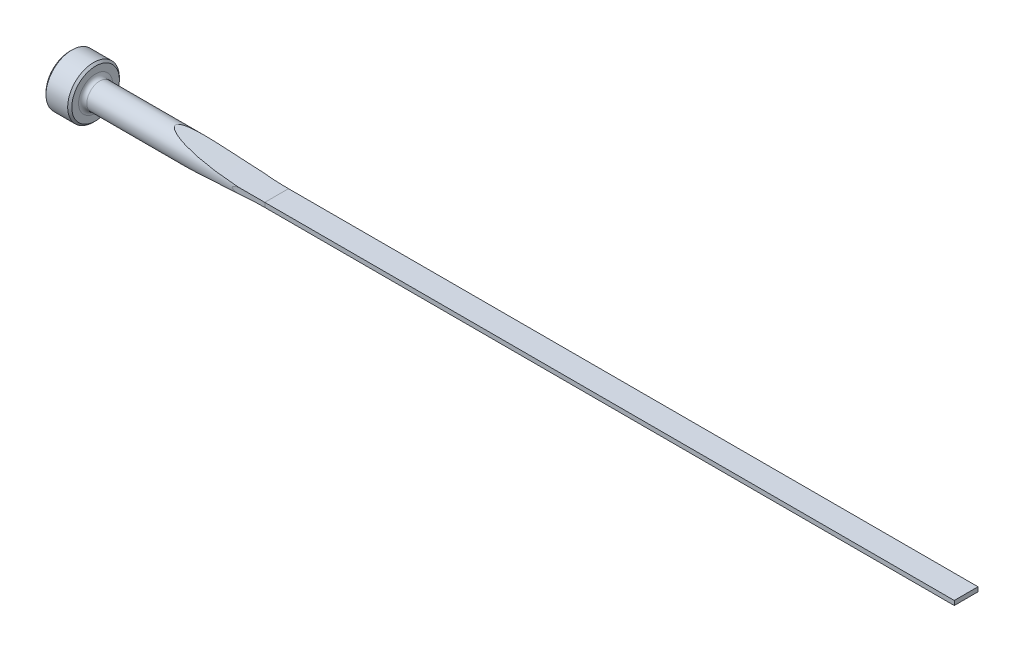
ISO-10303-21;
HEADER;
FILE_DESCRIPTION(('STEP AP214'),'2;1');
FILE_NAME('part.step','',(''),(''),'','','');
FILE_SCHEMA(('AUTOMOTIVE_DESIGN { 1 0 10303 214 1 1 1 1 }'));
ENDSEC;
DATA;
#1=APPLICATION_CONTEXT('core data for automotive mechanical design processes');
#2=APPLICATION_PROTOCOL_DEFINITION('international standard','automotive_design',2000,#1);
#3=PRODUCT_CONTEXT('',#1,'mechanical');
#4=PRODUCT('Part','Part','',(#3));
#5=PRODUCT_RELATED_PRODUCT_CATEGORY('part','',(#4));
#6=PRODUCT_DEFINITION_FORMATION('','',#4);
#7=PRODUCT_DEFINITION_CONTEXT('part definition',#1,'design');
#8=PRODUCT_DEFINITION('design','',#6,#7);
#9=PRODUCT_DEFINITION_SHAPE('','',#8);
#10=(LENGTH_UNIT() NAMED_UNIT(*) SI_UNIT(.MILLI.,.METRE.));
#11=(NAMED_UNIT(*) PLANE_ANGLE_UNIT() SI_UNIT($,.RADIAN.));
#12=(NAMED_UNIT(*) SI_UNIT($,.STERADIAN.) SOLID_ANGLE_UNIT());
#13=UNCERTAINTY_MEASURE_WITH_UNIT(LENGTH_MEASURE(1.E-05),#10,'distance_accuracy_value','');
#14=(GEOMETRIC_REPRESENTATION_CONTEXT(3) GLOBAL_UNCERTAINTY_ASSIGNED_CONTEXT((#13)) GLOBAL_UNIT_ASSIGNED_CONTEXT((#10,
#11,#12)) REPRESENTATION_CONTEXT('',''));
#15=CARTESIAN_POINT('',(0.,0.,0.));
#16=DIRECTION('',(0.,0.,1.));
#17=DIRECTION('',(1.,0.,0.));
#18=AXIS2_PLACEMENT_3D('',#15,#16,#17);
#19=CARTESIAN_POINT('',(0.,0.,0.));
#20=DIRECTION('',(-1.,0.,0.));
#21=DIRECTION('',(0.,0.,1.));
#22=AXIS2_PLACEMENT_3D('',#19,#20,#21);
#23=CYLINDRICAL_SURFACE('',#22,2.3749);
#24=CARTESIAN_POINT('',(5.5118,0.,0.));
#25=DIRECTION('',(-1.,0.,0.));
#26=DIRECTION('',(0.,0.,1.));
#27=AXIS2_PLACEMENT_3D('',#24,#25,#26);
#28=CIRCLE('',#27,2.3749);
#29=CARTESIAN_POINT('',(5.5118,0.,2.3749));
#30=VERTEX_POINT('',#29);
#31=EDGE_CURVE('E153',#30,#30,#28,.F.);
#32=ORIENTED_EDGE('',*,*,#31,.T.);
#33=EDGE_LOOP('',(#32));
#34=FACE_BOUND('',#33,.T.);
#35=CARTESIAN_POINT('',(38.1,0.931958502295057,2.18439999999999));
#36=CARTESIAN_POINT('',(37.9075515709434,0.931940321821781,2.18439976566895));
#37=CARTESIAN_POINT('',(37.7151013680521,0.930492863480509,2.18502490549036));
#38=CARTESIAN_POINT('',(37.3302234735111,0.924611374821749,2.18752450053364));
#39=CARTESIAN_POINT('',(37.1377957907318,0.920176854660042,2.18939916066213));
#40=CARTESIAN_POINT('',(36.7518341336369,0.908155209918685,2.19441218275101));
#41=CARTESIAN_POINT('',(36.5583008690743,0.900548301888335,2.19755847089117));
#42=CARTESIAN_POINT('',(36.1714442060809,0.881895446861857,2.20511052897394));
#43=CARTESIAN_POINT('',(35.9781207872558,0.870849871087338,2.20951616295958));
#44=CARTESIAN_POINT('',(35.5803005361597,0.844100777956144,2.21987943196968));
#45=CARTESIAN_POINT('',(35.3758212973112,0.828159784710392,2.2259136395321));
#46=CARTESIAN_POINT('',(34.9673129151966,0.791030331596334,2.23937732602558));
#47=CARTESIAN_POINT('',(34.7632839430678,0.769840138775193,2.24680726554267));
#48=CARTESIAN_POINT('',(34.35661740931,0.720830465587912,2.26301546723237));
#49=CARTESIAN_POINT('',(34.1539775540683,0.693029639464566,2.27178991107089));
#50=CARTESIAN_POINT('',(33.8512709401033,0.644172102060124,2.28592867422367));
#51=CARTESIAN_POINT('',(33.750603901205,0.626699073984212,2.29080303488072));
#52=CARTESIAN_POINT('',(33.5498678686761,0.588702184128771,2.30086330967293));
#53=CARTESIAN_POINT('',(33.4497987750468,0.568178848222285,2.30604917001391));
#54=CARTESIAN_POINT('',(33.3018199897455,0.534634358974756,2.31396676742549));
#55=CARTESIAN_POINT('',(33.2535509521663,0.523182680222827,2.3165891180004));
#56=CARTESIAN_POINT('',(33.1573085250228,0.499097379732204,2.32189592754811));
#57=CARTESIAN_POINT('',(33.1093351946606,0.486463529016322,2.32458039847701));
#58=CARTESIAN_POINT('',(32.9663526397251,0.446582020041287,2.33269738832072));
#59=CARTESIAN_POINT('',(32.8718724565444,0.417265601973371,2.33821536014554));
#60=CARTESIAN_POINT('',(32.7453639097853,0.370835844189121,2.34580058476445));
#61=CARTESIAN_POINT('',(32.7118331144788,0.357819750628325,2.34783049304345));
#62=CARTESIAN_POINT('',(32.6453758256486,0.330089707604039,2.35189084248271));
#63=CARTESIAN_POINT('',(32.61245087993,0.315371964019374,2.35392127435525));
#64=CARTESIAN_POINT('',(32.5466649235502,0.28318239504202,2.35801388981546));
#65=CARTESIAN_POINT('',(32.5138393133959,0.265637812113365,2.36007502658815));
#66=CARTESIAN_POINT('',(32.4503018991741,0.227094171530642,2.36409846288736));
#67=CARTESIAN_POINT('',(32.4195817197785,0.206110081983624,2.36606114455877));
#68=CARTESIAN_POINT('',(32.3807522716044,0.17363214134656,2.36855971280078));
#69=CARTESIAN_POINT('',(32.3706531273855,0.164553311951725,2.36921145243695));
#70=CARTESIAN_POINT('',(32.3513357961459,0.145453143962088,2.3704611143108));
#71=CARTESIAN_POINT('',(32.3421190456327,0.135430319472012,2.3710589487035));
#72=CARTESIAN_POINT('',(32.3248924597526,0.114162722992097,2.372178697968));
#73=CARTESIAN_POINT('',(32.3168989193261,0.10290439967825,2.3726995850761));
#74=CARTESIAN_POINT('',(32.3029630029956,0.0791761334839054,2.37360916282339));
#75=CARTESIAN_POINT('',(32.2970130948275,0.0667108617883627,2.37399833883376));
#76=CARTESIAN_POINT('',(32.2895493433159,0.0451214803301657,2.37448695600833));
#77=CARTESIAN_POINT('',(32.287216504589,0.0362843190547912,2.37463982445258));
#78=CARTESIAN_POINT('',(32.284070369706,0.018342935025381,2.3748460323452));
#79=CARTESIAN_POINT('',(32.28325542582,0.00923901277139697,2.37489947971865));
#80=CARTESIAN_POINT('',(32.2832396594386,-0.00898512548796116,2.37490051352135));
#81=CARTESIAN_POINT('',(32.2840414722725,-0.0181053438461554,2.37484792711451));
#82=CARTESIAN_POINT('',(32.2871682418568,-0.0360804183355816,2.37464298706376));
#83=CARTESIAN_POINT('',(32.2894948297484,-0.0449349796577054,2.37449052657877));
#84=CARTESIAN_POINT('',(32.296426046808,-0.0650505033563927,2.37403676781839));
#85=CARTESIAN_POINT('',(32.3015301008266,-0.0761364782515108,2.37370288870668));
#86=CARTESIAN_POINT('',(32.3134090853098,-0.0973644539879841,2.37292722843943));
#87=CARTESIAN_POINT('',(32.320188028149,-0.10750410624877,2.37248518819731));
#88=CARTESIAN_POINT('',(32.3406526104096,-0.134467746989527,2.37115359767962));
#89=CARTESIAN_POINT('',(32.3555945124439,-0.150320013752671,2.37018436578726));
#90=CARTESIAN_POINT('',(32.3874630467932,-0.179846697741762,2.36812651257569));
#91=CARTESIAN_POINT('',(32.4043958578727,-0.193514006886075,2.36703752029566));
#92=CARTESIAN_POINT('',(32.4500057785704,-0.226993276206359,2.36411848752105));
#93=CARTESIAN_POINT('',(32.4796018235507,-0.245533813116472,2.36223795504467));
#94=CARTESIAN_POINT('',(32.5403493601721,-0.279898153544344,2.3584104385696));
#95=CARTESIAN_POINT('',(32.5715045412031,-0.295715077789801,2.35646330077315));
#96=CARTESIAN_POINT('',(32.6666093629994,-0.340418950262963,2.35057165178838));
#97=CARTESIAN_POINT('',(32.7319170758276,-0.366382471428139,2.34659497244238));
#98=CARTESIAN_POINT('',(32.8741782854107,-0.417382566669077,2.3380950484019));
#99=CARTESIAN_POINT('',(32.9513848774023,-0.441669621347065,2.33358126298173));
#100=CARTESIAN_POINT('',(33.106961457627,-0.486276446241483,2.32469268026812));
#101=CARTESIAN_POINT('',(33.1853319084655,-0.506594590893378,2.32031794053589));
#102=CARTESIAN_POINT('',(33.4218439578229,-0.563416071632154,2.30743335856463));
#103=CARTESIAN_POINT('',(33.5810064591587,-0.595665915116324,2.29918591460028));
#104=CARTESIAN_POINT('',(33.9005735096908,-0.653182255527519,2.28349651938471));
#105=CARTESIAN_POINT('',(34.06097818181,-0.678448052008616,2.27605464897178));
#106=CARTESIAN_POINT('',(34.3823165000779,-0.723854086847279,2.26202300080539));
#107=CARTESIAN_POINT('',(34.5432491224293,-0.744001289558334,2.25543207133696));
#108=CARTESIAN_POINT('',(34.9686966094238,-0.792003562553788,2.23917011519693));
#109=CARTESIAN_POINT('',(35.2336093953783,-0.816543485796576,2.23022625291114));
#110=CARTESIAN_POINT('',(35.7642384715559,-0.85775890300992,2.21469349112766));
#111=CARTESIAN_POINT('',(36.0299551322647,-0.874429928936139,2.20810593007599));
#112=CARTESIAN_POINT('',(36.5612705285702,-0.901186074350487,2.19732116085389));
#113=CARTESIAN_POINT('',(36.8268685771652,-0.91128328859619,2.19311956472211));
#114=CARTESIAN_POINT('',(37.3582486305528,-0.92564325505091,2.18709742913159));
#115=CARTESIAN_POINT('',(37.6240306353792,-0.929906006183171,2.18527689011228));
#116=CARTESIAN_POINT('',(37.9598826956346,-0.931763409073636,2.18448280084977));
#117=CARTESIAN_POINT('',(38.0299416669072,-0.931956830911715,2.18439997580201));
#118=CARTESIAN_POINT('',(38.1,-0.931958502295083,2.18439999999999));
#119=B_SPLINE_CURVE_WITH_KNOTS('',3,(#35,#36,#37,#38,#39,#40,#41,#42,#43,#44,#45,#46,#47,#48,
#49,#50,#51,#52,#53,#54,#55,#56,#57,#58,#59,#60,#61,#62,#63,#64,#65,#66,#67,#68,#69,#70,#71,#72,
#73,#74,#75,#76,#77,#78,#79,#80,#81,#82,#83,#84,#85,#86,#87,#88,#89,#90,#91,#92,#93,#94,#95,#96,
#97,#98,#99,#100,#101,#102,#103,#104,#105,#106,#107,#108,#109,#110,#111,#112,#113,#114,#115,
#116,#117,#118),.UNSPECIFIED.,.F.,.F.,(4,2,2,2,2,2,2,2,2,2,2,2,2,2,2,2,2,2,2,2,2,2,2,2,2,2,2,2,
2,2,2,2,2,2,2,2,2,2,2,2,2,4),(0.,0.577341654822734,1.15477801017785,1.73587049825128,
2.31690027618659,2.93240275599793,3.54810870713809,4.16209742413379,4.46893047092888,
4.77571068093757,4.9247288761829,5.07377599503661,5.37061535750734,5.47866452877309,
5.58695943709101,5.69870175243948,5.80997010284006,5.85071283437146,5.89152080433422,
5.93283229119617,5.97398983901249,6.00129967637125,6.02857985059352,6.05590452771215,
6.08325848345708,6.11967760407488,6.1561848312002,6.22123367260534,6.28649000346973,
6.39114062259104,6.49605180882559,6.70686384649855,6.94992813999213,7.19309177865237,
7.68061293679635,8.16818297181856,8.65508602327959,9.45349626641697,10.2523593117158,
11.0497483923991,11.8471376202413,12.0573140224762),.UNSPECIFIED.);
#120=CARTESIAN_POINT('',(33.3071074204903,0.535694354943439,2.31369435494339));
#121=VERTEX_POINT('',#120);
#122=CARTESIAN_POINT('',(33.3071074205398,-0.535694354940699,2.31369435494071));
#123=VERTEX_POINT('',#122);
#124=EDGE_CURVE('E156',#121,#123,#119,.T.);
#125=ORIENTED_EDGE('',*,*,#124,.F.);
#126=CARTESIAN_POINT('',(38.1,0.406400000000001,2.33986945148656));
#127=CARTESIAN_POINT('',(37.7044168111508,0.406399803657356,2.33984948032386));
#128=CARTESIAN_POINT('',(37.3088333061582,0.409040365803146,2.33941010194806));
#129=CARTESIAN_POINT('',(36.5177233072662,0.419601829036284,2.33754961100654));
#130=CARTESIAN_POINT('',(36.1221968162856,0.4275229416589,2.33612845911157));
#131=CARTESIAN_POINT('',(35.3304473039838,0.448666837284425,2.33215725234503));
#132=CARTESIAN_POINT('',(34.9342245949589,0.461900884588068,2.32960479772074));
#133=CARTESIAN_POINT('',(34.1420171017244,0.493667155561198,2.32308149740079));
#134=CARTESIAN_POINT('',(33.7460323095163,0.51219918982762,2.31911070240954));
#135=CARTESIAN_POINT('',(32.9535202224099,0.554602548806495,2.30933764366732));
#136=CARTESIAN_POINT('',(32.5569935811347,0.578485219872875,2.30353147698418));
#137=CARTESIAN_POINT('',(31.7643370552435,0.631560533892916,2.28954911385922));
#138=CARTESIAN_POINT('',(31.3682071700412,0.660753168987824,2.28137292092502));
#139=CARTESIAN_POINT('',(30.5763063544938,0.724449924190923,2.26195322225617));
#140=CARTESIAN_POINT('',(30.1805356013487,0.758955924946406,2.25070862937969));
#141=CARTESIAN_POINT('',(29.3896269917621,0.833256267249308,2.22427297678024));
#142=CARTESIAN_POINT('',(28.9944891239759,0.873050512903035,2.20908198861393));
#143=CARTESIAN_POINT('',(28.2053195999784,0.957870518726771,2.17364869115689));
#144=CARTESIAN_POINT('',(27.8112873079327,1.00289202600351,2.15341047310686));
#145=CARTESIAN_POINT('',(27.0242497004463,1.0981527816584,2.10642646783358));
#146=CARTESIAN_POINT('',(26.6312443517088,1.14839185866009,2.07968089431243));
#147=CARTESIAN_POINT('',(25.8467997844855,1.25399752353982,2.01777261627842));
#148=CARTESIAN_POINT('',(25.4553597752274,1.30936105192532,1.98261491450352));
#149=CARTESIAN_POINT('',(24.8696668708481,1.39617734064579,1.92147807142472));
#150=CARTESIAN_POINT('',(24.6746928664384,1.42574258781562,1.8997007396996));
#151=CARTESIAN_POINT('',(24.2853329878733,1.48610747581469,1.85286228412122));
#152=CARTESIAN_POINT('',(24.090947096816,1.51690708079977,1.82780125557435));
#153=CARTESIAN_POINT('',(23.7027972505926,1.57972659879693,1.77379004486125));
#154=CARTESIAN_POINT('',(23.5090337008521,1.61174718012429,1.74483771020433));
#155=CARTESIAN_POINT('',(23.1224234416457,1.67694930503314,1.68227119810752));
#156=CARTESIAN_POINT('',(22.9295768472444,1.71013099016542,1.64865645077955));
#157=CARTESIAN_POINT('',(22.5454982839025,1.77751664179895,1.57576815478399));
#158=CARTESIAN_POINT('',(22.3542640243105,1.81171864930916,1.53650495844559));
#159=CARTESIAN_POINT('',(21.9736080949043,1.88107830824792,1.45077652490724));
#160=CARTESIAN_POINT('',(21.7841859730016,1.91623571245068,1.40431313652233));
#161=CARTESIAN_POINT('',(21.4545415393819,1.9785150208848,1.3144663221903));
#162=CARTESIAN_POINT('',(21.3137260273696,2.00547620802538,1.27315803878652));
#163=CARTESIAN_POINT('',(21.0340568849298,2.05971596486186,1.18342755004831));
#164=CARTESIAN_POINT('',(20.8952077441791,2.0869950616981,1.13499127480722));
#165=CARTESIAN_POINT('',(20.6903441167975,2.12774040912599,1.05533759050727));
#166=CARTESIAN_POINT('',(20.6229205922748,2.14123294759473,1.027759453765));
#167=CARTESIAN_POINT('',(20.4893070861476,2.16812981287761,0.969737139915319));
#168=CARTESIAN_POINT('',(20.4231168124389,2.18153416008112,0.939293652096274));
#169=CARTESIAN_POINT('',(20.2926184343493,2.20811308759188,0.874982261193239));
#170=CARTESIAN_POINT('',(20.2283052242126,2.22128824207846,0.841125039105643));
#171=CARTESIAN_POINT('',(20.1021420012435,2.24727503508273,0.769012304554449));
#172=CARTESIAN_POINT('',(20.0402897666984,2.26008699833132,0.730760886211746));
#173=CARTESIAN_POINT('',(19.9403180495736,2.28090012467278,0.662165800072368));
#174=CARTESIAN_POINT('',(19.9011456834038,2.28908441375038,0.63342184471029));
#175=CARTESIAN_POINT('',(19.8251269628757,2.30501770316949,0.572739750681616));
#176=CARTESIAN_POINT('',(19.7882839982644,2.31276606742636,0.540797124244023));
#177=CARTESIAN_POINT('',(19.7177924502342,2.32763389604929,0.472755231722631));
#178=CARTESIAN_POINT('',(19.6841755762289,2.33474707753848,0.43662116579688));
#179=CARTESIAN_POINT('',(19.622498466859,2.34782984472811,0.359666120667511));
#180=CARTESIAN_POINT('',(19.5944234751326,2.3538024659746,0.318858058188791));
#181=CARTESIAN_POINT('',(19.5557647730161,2.3620409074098,0.248316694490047));
#182=CARTESIAN_POINT('',(19.542557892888,2.3648594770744,0.220101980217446));
#183=CARTESIAN_POINT('',(19.5205811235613,2.36955326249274,0.161913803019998));
#184=CARTESIAN_POINT('',(19.5118054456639,2.37142970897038,0.131942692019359));
#185=CARTESIAN_POINT('',(19.4995504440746,2.37405090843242,0.0705758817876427));
#186=CARTESIAN_POINT('',(19.496118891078,2.3747854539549,0.0391698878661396));
#187=CARTESIAN_POINT('',(19.4951655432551,2.37498947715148,-0.0237379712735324));
#188=CARTESIAN_POINT('',(19.4976430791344,2.37445909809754,-0.0552398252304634));
#189=CARTESIAN_POINT('',(19.5076355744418,2.37232149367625,-0.114120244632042));
#190=CARTESIAN_POINT('',(19.5146229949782,2.37082704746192,-0.141596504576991));
#191=CARTESIAN_POINT('',(19.5324513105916,2.36701756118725,-0.195194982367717));
#192=CARTESIAN_POINT('',(19.5432944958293,2.36470203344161,-0.221316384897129));
#193=CARTESIAN_POINT('',(19.575995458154,2.35772732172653,-0.28812157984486));
#194=CARTESIAN_POINT('',(19.6004661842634,2.35251555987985,-0.327458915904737));
#195=CARTESIAN_POINT('',(19.6549219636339,2.34094780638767,-0.401925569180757));
#196=CARTESIAN_POINT('',(19.6849249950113,2.3345880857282,-0.437040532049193));
#197=CARTESIAN_POINT('',(19.7478725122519,2.32128385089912,-0.502883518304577));
#198=CARTESIAN_POINT('',(19.7807403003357,2.31435476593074,-0.533689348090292));
#199=CARTESIAN_POINT('',(19.8489037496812,2.30002838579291,-0.59239598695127));
#200=CARTESIAN_POINT('',(19.8842018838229,2.292630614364,-0.620293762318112));
#201=CARTESIAN_POINT('',(19.9565971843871,2.27750649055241,-0.673710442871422));
#202=CARTESIAN_POINT('',(19.9936982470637,2.26977943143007,-0.699223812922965));
#203=CARTESIAN_POINT('',(20.0691612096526,2.25411491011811,-0.748180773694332));
#204=CARTESIAN_POINT('',(20.1075225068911,2.24617754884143,-0.771625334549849));
#205=CARTESIAN_POINT('',(20.2136713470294,2.22428956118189,-0.833316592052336));
#206=CARTESIAN_POINT('',(20.2824349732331,2.2101921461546,-0.869829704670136));
#207=CARTESIAN_POINT('',(20.4219229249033,2.18177272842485,-0.938828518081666));
#208=CARTESIAN_POINT('',(20.4926484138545,2.16745059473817,-0.971311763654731));
#209=CARTESIAN_POINT('',(20.7071388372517,2.12429388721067,-1.06406057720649));
#210=CARTESIAN_POINT('',(20.8529626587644,2.0953216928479,-1.11948666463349));
#211=CARTESIAN_POINT('',(21.1483943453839,2.03741406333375,-1.2216871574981));
#212=CARTESIAN_POINT('',(21.2980180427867,2.00847961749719,-1.26841467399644));
#213=CARTESIAN_POINT('',(21.5238574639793,1.965416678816,-1.33339980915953));
#214=CARTESIAN_POINT('',(21.5993227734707,1.95112780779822,-1.3541988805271));
#215=CARTESIAN_POINT('',(21.7506704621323,1.92267524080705,-1.39430070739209));
#216=CARTESIAN_POINT('',(21.8265528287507,1.90851154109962,-1.41360350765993));
#217=CARTESIAN_POINT('',(22.0813454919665,1.86129873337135,-1.47605728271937));
#218=CARTESIAN_POINT('',(22.261048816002,1.82856748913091,-1.51622419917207));
#219=CARTESIAN_POINT('',(22.6218079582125,1.76401499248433,-1.59085660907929));
#220=CARTESIAN_POINT('',(22.8028640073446,1.73219390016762,-1.62532110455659));
#221=CARTESIAN_POINT('',(23.1660633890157,1.66952697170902,-1.68962914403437));
#222=CARTESIAN_POINT('',(23.3482072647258,1.63868168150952,-1.71947013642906));
#223=CARTESIAN_POINT('',(23.7132627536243,1.57803492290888,-1.77528798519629));
#224=CARTESIAN_POINT('',(23.8961744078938,1.54823351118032,-1.80126463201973));
#225=CARTESIAN_POINT('',(24.4467186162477,1.46030598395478,-1.87443797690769));
#226=CARTESIAN_POINT('',(24.8152663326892,1.40381094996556,-1.91672647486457));
#227=CARTESIAN_POINT('',(25.553854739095,1.29535770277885,-1.99160931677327));
#228=CARTESIAN_POINT('',(25.9238949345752,1.24339809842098,-2.02420664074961));
#229=CARTESIAN_POINT('',(26.6651082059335,1.1440892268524,-2.08194780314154));
#230=CARTESIAN_POINT('',(27.03628110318,1.0967392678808,-2.10709276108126));
#231=CARTESIAN_POINT('',(27.7795583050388,1.00669079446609,-2.15156688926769));
#232=CARTESIAN_POINT('',(28.1516626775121,0.96399262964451,-2.17089562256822));
#233=CARTESIAN_POINT('',(28.896097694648,0.88333642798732,-2.20494434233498));
#234=CARTESIAN_POINT('',(29.2684274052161,0.84537225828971,-2.2196703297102));
#235=CARTESIAN_POINT('',(30.0136629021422,0.774138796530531,-2.24550424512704));
#236=CARTESIAN_POINT('',(30.3865686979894,0.740869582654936,-2.25661211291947));
#237=CARTESIAN_POINT('',(31.3600128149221,0.660219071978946,-2.28188501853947));
#238=CARTESIAN_POINT('',(31.9609226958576,0.616576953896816,-2.29379434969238));
#239=CARTESIAN_POINT('',(33.1637415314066,0.541505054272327,-2.31266265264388));
#240=CARTESIAN_POINT('',(33.7656507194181,0.510078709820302,-2.31962023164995));
#241=CARTESIAN_POINT('',(34.9692581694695,0.4595046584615,-2.33016558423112));
#242=CARTESIAN_POINT('',(35.5709557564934,0.440341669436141,-2.3337575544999));
#243=CARTESIAN_POINT('',(36.7746207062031,0.414242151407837,-2.33853166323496));
#244=CARTESIAN_POINT('',(37.3765880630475,0.407305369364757,-2.33971385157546));
#245=CARTESIAN_POINT('',(38.0190317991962,0.406427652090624,-2.3398645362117));
#246=CARTESIAN_POINT('',(38.059515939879,0.406399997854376,-2.3398693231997));
#247=CARTESIAN_POINT('',(38.1,0.406399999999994,-2.33986945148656));
#248=B_SPLINE_CURVE_WITH_KNOTS('',3,(#126,#127,#128,#129,#130,#131,#132,#133,#134,#135,#136,
#137,#138,#139,#140,#141,#142,#143,#144,#145,#146,#147,#148,#149,#150,#151,#152,#153,#154,#155,
#156,#157,#158,#159,#160,#161,#162,#163,#164,#165,#166,#167,#168,#169,#170,#171,#172,#173,#174,
#175,#176,#177,#178,#179,#180,#181,#182,#183,#184,#185,#186,#187,#188,#189,#190,#191,#192,#193,
#194,#195,#196,#197,#198,#199,#200,#201,#202,#203,#204,#205,#206,#207,#208,#209,#210,#211,#212,
#213,#214,#215,#216,#217,#218,#219,#220,#221,#222,#223,#224,#225,#226,#227,#228,#229,#230,#231,
#232,#233,#234,#235,#236,#237,#238,#239,#240,#241,#242,#243,#244,#245,#246,#247),.UNSPECIFIED.,
.F.,.F.,(4,2,2,2,2,2,2,2,2,2,2,2,2,2,2,2,2,2,2,2,2,2,2,2,2,2,2,2,2,2,2,2,2,2,2,2,2,2,2,2,2,2,2,
2,2,2,2,2,2,2,2,2,2,2,2,2,2,2,2,2,4),(0.,1.18674101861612,2.37352958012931,3.5628477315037,
4.75212337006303,5.94394522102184,7.13576530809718,8.32800820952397,9.52022949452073,
10.7114874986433,11.9027063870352,13.0932186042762,13.6883984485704,14.2835610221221,
14.8790541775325,15.4746201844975,16.0691082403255,16.6634438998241,17.1109425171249,
17.5593366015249,17.781541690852,18.0036934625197,18.2251705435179,18.4464429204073,
18.5941408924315,18.7420490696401,18.8912874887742,19.0401230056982,19.1336595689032,
19.2270736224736,19.3213179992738,19.4155517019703,19.5003787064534,19.5852561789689,
19.7243067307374,19.8638173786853,20.0003421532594,20.1370079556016,20.2739835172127,
20.4108945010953,20.6480705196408,20.8853903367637,21.3609114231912,21.838925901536,
22.077629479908,22.3163259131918,22.8772603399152,23.4382928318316,23.99963385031,
24.5610052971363,25.6865059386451,26.811660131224,27.9366452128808,29.0617147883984,
30.1853113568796,31.3089266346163,33.1165903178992,34.9247622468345,36.7306764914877,
38.5365533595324,38.658005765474),.UNSPECIFIED.);
#249=CARTESIAN_POINT('',(33.3071074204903,0.53569435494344,-2.31369435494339));
#250=VERTEX_POINT('',#249);
#251=EDGE_CURVE('E106',#121,#250,#248,.T.);
#252=ORIENTED_EDGE('',*,*,#251,.T.);
#253=CARTESIAN_POINT('',(38.1,0.931958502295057,-2.18439999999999));
#254=CARTESIAN_POINT('',(37.9075515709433,0.931940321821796,-2.18439976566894));
#255=CARTESIAN_POINT('',(37.715101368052,0.930492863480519,-2.18502490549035));
#256=CARTESIAN_POINT('',(37.3302234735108,0.924611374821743,-2.18752450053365));
#257=CARTESIAN_POINT('',(37.1377957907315,0.920176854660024,-2.18939916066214));
#258=CARTESIAN_POINT('',(36.7518341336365,0.908155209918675,-2.19441218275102));
#259=CARTESIAN_POINT('',(36.5583008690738,0.900548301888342,-2.19755847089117));
#260=CARTESIAN_POINT('',(36.1714442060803,0.881895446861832,-2.20511052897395));
#261=CARTESIAN_POINT('',(35.9781207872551,0.870849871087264,-2.20951616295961));
#262=CARTESIAN_POINT('',(35.580300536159,0.844100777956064,-2.21987943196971));
#263=CARTESIAN_POINT('',(35.3758212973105,0.828159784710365,-2.22591363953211));
#264=CARTESIAN_POINT('',(34.9673129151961,0.791030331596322,-2.23937732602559));
#265=CARTESIAN_POINT('',(34.7632839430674,0.769840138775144,-2.24680726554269));
#266=CARTESIAN_POINT('',(34.3566174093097,0.720830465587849,-2.26301546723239));
#267=CARTESIAN_POINT('',(34.153977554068,0.693029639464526,-2.2717899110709));
#268=CARTESIAN_POINT('',(33.8512709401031,0.644172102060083,-2.28592867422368));
#269=CARTESIAN_POINT('',(33.7506039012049,0.626699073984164,-2.29080303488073));
#270=CARTESIAN_POINT('',(33.549867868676,0.588702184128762,-2.30086330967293));
#271=CARTESIAN_POINT('',(33.4497987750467,0.568178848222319,-2.3060491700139));
#272=CARTESIAN_POINT('',(33.3018199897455,0.534634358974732,-2.3139667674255));
#273=CARTESIAN_POINT('',(33.2535509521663,0.523182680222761,-2.31658911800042));
#274=CARTESIAN_POINT('',(33.1573085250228,0.499097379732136,-2.32189592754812));
#275=CARTESIAN_POINT('',(33.1093351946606,0.486463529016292,-2.32458039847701));
#276=CARTESIAN_POINT('',(32.9663526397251,0.446582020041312,-2.33269738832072));
#277=CARTESIAN_POINT('',(32.8718724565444,0.417265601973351,-2.33821536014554));
#278=CARTESIAN_POINT('',(32.7453639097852,0.37083584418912,-2.34580058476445));
#279=CARTESIAN_POINT('',(32.7118331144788,0.357819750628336,-2.34783049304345));
#280=CARTESIAN_POINT('',(32.6453758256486,0.330089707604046,-2.35189084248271));
#281=CARTESIAN_POINT('',(32.61245087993,0.315371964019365,-2.35392127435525));
#282=CARTESIAN_POINT('',(32.5466649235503,0.28318239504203,-2.35801388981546));
#283=CARTESIAN_POINT('',(32.5138393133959,0.26563781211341,-2.36007502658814));
#284=CARTESIAN_POINT('',(32.4503018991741,0.227094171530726,-2.36409846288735));
#285=CARTESIAN_POINT('',(32.4195817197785,0.206110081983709,-2.36606114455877));
#286=CARTESIAN_POINT('',(32.3807522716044,0.173632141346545,-2.36855971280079));
#287=CARTESIAN_POINT('',(32.3706531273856,0.164553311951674,-2.36921145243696));
#288=CARTESIAN_POINT('',(32.351335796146,0.145453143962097,-2.3704611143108));
#289=CARTESIAN_POINT('',(32.3421190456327,0.135430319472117,-2.37105894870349));
#290=CARTESIAN_POINT('',(32.3248924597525,0.114162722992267,-2.37217869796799));
#291=CARTESIAN_POINT('',(32.316898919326,0.102904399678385,-2.37269958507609));
#292=CARTESIAN_POINT('',(32.3029630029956,0.0791761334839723,-2.37360916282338));
#293=CARTESIAN_POINT('',(32.2970130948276,0.0667108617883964,-2.37399833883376));
#294=CARTESIAN_POINT('',(32.2895493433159,0.0451214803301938,-2.37448695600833));
#295=CARTESIAN_POINT('',(32.2872165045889,0.0362843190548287,-2.37463982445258));
#296=CARTESIAN_POINT('',(32.284070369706,0.0183429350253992,-2.3748460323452));
#297=CARTESIAN_POINT('',(32.2832554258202,0.0092390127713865,-2.37489947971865));
#298=CARTESIAN_POINT('',(32.2832396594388,-0.00898512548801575,-2.37490051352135));
#299=CARTESIAN_POINT('',(32.2840414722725,-0.0181053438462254,-2.37484792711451));
#300=CARTESIAN_POINT('',(32.2871682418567,-0.0360804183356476,-2.37464298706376));
#301=CARTESIAN_POINT('',(32.2894948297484,-0.0449349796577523,-2.37449052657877));
#302=CARTESIAN_POINT('',(32.2964260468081,-0.0650505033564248,-2.37403676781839));
#303=CARTESIAN_POINT('',(32.3015301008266,-0.0761364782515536,-2.37370288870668));
#304=CARTESIAN_POINT('',(32.3134090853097,-0.0973644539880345,-2.37292722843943));
#305=CARTESIAN_POINT('',(32.320188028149,-0.107504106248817,-2.3724851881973));
#306=CARTESIAN_POINT('',(32.3406526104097,-0.134467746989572,-2.37115359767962));
#307=CARTESIAN_POINT('',(32.355594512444,-0.15032001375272,-2.37018436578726));
#308=CARTESIAN_POINT('',(32.3874630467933,-0.179846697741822,-2.36812651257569));
#309=CARTESIAN_POINT('',(32.4043958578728,-0.193514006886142,-2.36703752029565));
#310=CARTESIAN_POINT('',(32.4500057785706,-0.226993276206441,-2.36411848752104));
#311=CARTESIAN_POINT('',(32.4796018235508,-0.245533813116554,-2.36223795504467));
#312=CARTESIAN_POINT('',(32.5403493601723,-0.279898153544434,-2.35841043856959));
#313=CARTESIAN_POINT('',(32.5715045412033,-0.295715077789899,-2.35646330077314));
#314=CARTESIAN_POINT('',(32.6666093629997,-0.34041895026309,-2.35057165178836));
#315=CARTESIAN_POINT('',(32.7319170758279,-0.366382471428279,-2.34659497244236));
#316=CARTESIAN_POINT('',(32.8741782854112,-0.417382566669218,-2.33809504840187));
#317=CARTESIAN_POINT('',(32.9513848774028,-0.441669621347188,-2.33358126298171));
#318=CARTESIAN_POINT('',(33.1069614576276,-0.486276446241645,-2.32469268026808));
#319=CARTESIAN_POINT('',(33.1853319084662,-0.506594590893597,-2.32031794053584));
#320=CARTESIAN_POINT('',(33.4218439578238,-0.563416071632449,-2.30743335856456));
#321=CARTESIAN_POINT('',(33.5810064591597,-0.595665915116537,-2.29918591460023));
#322=CARTESIAN_POINT('',(33.9005735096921,-0.653182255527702,-2.28349651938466));
#323=CARTESIAN_POINT('',(34.0609781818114,-0.678448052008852,-2.27605464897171));
#324=CARTESIAN_POINT('',(34.3823165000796,-0.723854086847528,-2.26202300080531));
#325=CARTESIAN_POINT('',(34.5432491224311,-0.744001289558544,-2.25543207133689));
#326=CARTESIAN_POINT('',(34.9686966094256,-0.792003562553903,-2.23917011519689));
#327=CARTESIAN_POINT('',(35.2336093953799,-0.816543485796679,-2.2302262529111));
#328=CARTESIAN_POINT('',(35.7642384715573,-0.85775890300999,-2.21469349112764));
#329=CARTESIAN_POINT('',(36.0299551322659,-0.874429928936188,-2.20810593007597));
#330=CARTESIAN_POINT('',(36.561270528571,-0.901186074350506,-2.19732116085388));
#331=CARTESIAN_POINT('',(36.826868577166,-0.911283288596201,-2.1931195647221));
#332=CARTESIAN_POINT('',(37.3582486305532,-0.925643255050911,-2.18709742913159));
#333=CARTESIAN_POINT('',(37.6240306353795,-0.92990600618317,-2.18527689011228));
#334=CARTESIAN_POINT('',(37.9598826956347,-0.931763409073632,-2.18448280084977));
#335=CARTESIAN_POINT('',(38.0299416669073,-0.931956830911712,-2.18439997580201));
#336=CARTESIAN_POINT('',(38.1,-0.931958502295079,-2.18439999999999));
#337=B_SPLINE_CURVE_WITH_KNOTS('',3,(#253,#254,#255,#256,#257,#258,#259,#260,#261,#262,#263,
#264,#265,#266,#267,#268,#269,#270,#271,#272,#273,#274,#275,#276,#277,#278,#279,#280,#281,#282,
#283,#284,#285,#286,#287,#288,#289,#290,#291,#292,#293,#294,#295,#296,#297,#298,#299,#300,#301,
#302,#303,#304,#305,#306,#307,#308,#309,#310,#311,#312,#313,#314,#315,#316,#317,#318,#319,#320,
#321,#322,#323,#324,#325,#326,#327,#328,#329,#330,#331,#332,#333,#334,#335,#336),.UNSPECIFIED.,
.F.,.F.,(4,2,2,2,2,2,2,2,2,2,2,2,2,2,2,2,2,2,2,2,2,2,2,2,2,2,2,2,2,2,2,2,2,2,2,2,2,2,2,2,2,4),
(0.,0.577341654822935,1.15477801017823,1.73587049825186,2.31690027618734,2.93240275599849,
3.54810870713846,4.16209742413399,4.46893047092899,4.77571068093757,4.9247288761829,
5.0737759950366,5.37061535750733,5.47866452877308,5.58695943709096,5.69870175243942,
5.80997010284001,5.85071283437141,5.89152080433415,5.93283229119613,5.97398983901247,
6.00129967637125,6.02857985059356,6.05590452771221,6.08325848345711,6.11967760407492,
6.15618483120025,6.22123367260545,6.28649000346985,6.39114062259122,6.49605180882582,
6.70686384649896,6.94992813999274,7.19309177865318,7.68061293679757,8.16818297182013,
8.65508602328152,9.45349626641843,10.2523593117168,11.0497483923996,11.8471376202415,
12.0573140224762),.UNSPECIFIED.);
#338=CARTESIAN_POINT('',(33.3071074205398,-0.535694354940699,-2.31369435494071));
#339=VERTEX_POINT('',#338);
#340=EDGE_CURVE('E175',#250,#339,#337,.T.);
#341=ORIENTED_EDGE('',*,*,#340,.T.);
#342=CARTESIAN_POINT('',(38.1,-0.406400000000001,2.33986945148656));
#343=CARTESIAN_POINT('',(37.7044168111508,-0.406399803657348,2.33984948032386));
#344=CARTESIAN_POINT('',(37.3088333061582,-0.409040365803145,2.33941010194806));
#345=CARTESIAN_POINT('',(36.5177233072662,-0.419601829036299,2.33754961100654));
#346=CARTESIAN_POINT('',(36.1221968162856,-0.427522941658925,2.33612845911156));
#347=CARTESIAN_POINT('',(35.3304473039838,-0.448666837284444,2.33215725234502));
#348=CARTESIAN_POINT('',(34.934224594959,-0.46190088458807,2.32960479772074));
#349=CARTESIAN_POINT('',(34.1420171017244,-0.493667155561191,2.32308149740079));
#350=CARTESIAN_POINT('',(33.7460323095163,-0.512199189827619,2.31911070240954));
#351=CARTESIAN_POINT('',(32.9535202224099,-0.554602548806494,2.30933764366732));
#352=CARTESIAN_POINT('',(32.5569935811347,-0.578485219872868,2.30353147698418));
#353=CARTESIAN_POINT('',(31.7643370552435,-0.631560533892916,2.28954911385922));
#354=CARTESIAN_POINT('',(31.3682071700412,-0.660753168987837,2.28137292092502));
#355=CARTESIAN_POINT('',(30.5763063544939,-0.72444992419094,2.26195322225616));
#356=CARTESIAN_POINT('',(30.1805356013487,-0.758955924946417,2.25070862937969));
#357=CARTESIAN_POINT('',(29.3896269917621,-0.833256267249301,2.22427297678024));
#358=CARTESIAN_POINT('',(28.9944891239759,-0.873050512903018,2.20908198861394));
#359=CARTESIAN_POINT('',(28.2053195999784,-0.957870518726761,2.1736486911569));
#360=CARTESIAN_POINT('',(27.8112873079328,-1.00289202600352,2.15341047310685));
#361=CARTESIAN_POINT('',(27.0242497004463,-1.09815278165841,2.10642646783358));
#362=CARTESIAN_POINT('',(26.6312443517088,-1.14839185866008,2.07968089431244));
#363=CARTESIAN_POINT('',(25.8467997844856,-1.25399752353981,2.01777261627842));
#364=CARTESIAN_POINT('',(25.4553597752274,-1.30936105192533,1.98261491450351));
#365=CARTESIAN_POINT('',(24.8696668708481,-1.39617734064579,1.92147807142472));
#366=CARTESIAN_POINT('',(24.6746928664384,-1.42574258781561,1.89970073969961));
#367=CARTESIAN_POINT('',(24.2853329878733,-1.48610747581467,1.85286228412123));
#368=CARTESIAN_POINT('',(24.090947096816,-1.51690708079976,1.82780125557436));
#369=CARTESIAN_POINT('',(23.7027972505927,-1.57972659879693,1.77379004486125));
#370=CARTESIAN_POINT('',(23.5090337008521,-1.61174718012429,1.74483771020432));
#371=CARTESIAN_POINT('',(23.1224234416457,-1.67694930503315,1.68227119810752));
#372=CARTESIAN_POINT('',(22.9295768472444,-1.71013099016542,1.64865645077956));
#373=CARTESIAN_POINT('',(22.5454982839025,-1.77751664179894,1.57576815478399));
#374=CARTESIAN_POINT('',(22.3542640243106,-1.81171864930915,1.53650495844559));
#375=CARTESIAN_POINT('',(21.9736080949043,-1.88107830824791,1.45077652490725));
#376=CARTESIAN_POINT('',(21.7841859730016,-1.91623571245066,1.40431313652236));
#377=CARTESIAN_POINT('',(21.4545415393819,-1.97851502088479,1.31446632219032));
#378=CARTESIAN_POINT('',(21.3137260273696,-2.00547620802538,1.27315803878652));
#379=CARTESIAN_POINT('',(21.0340568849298,-2.05971596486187,1.1834275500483));
#380=CARTESIAN_POINT('',(20.8952077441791,-2.08699506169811,1.13499127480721));
#381=CARTESIAN_POINT('',(20.6903441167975,-2.12774040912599,1.05533759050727));
#382=CARTESIAN_POINT('',(20.6229205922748,-2.14123294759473,1.027759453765));
#383=CARTESIAN_POINT('',(20.4893070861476,-2.16812981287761,0.969737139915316));
#384=CARTESIAN_POINT('',(20.4231168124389,-2.18153416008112,0.939293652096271));
#385=CARTESIAN_POINT('',(20.2926184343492,-2.20811308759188,0.874982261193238));
#386=CARTESIAN_POINT('',(20.2283052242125,-2.22128824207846,0.841125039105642));
#387=CARTESIAN_POINT('',(20.1021420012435,-2.24727503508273,0.769012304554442));
#388=CARTESIAN_POINT('',(20.0402897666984,-2.26008699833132,0.730760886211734));
#389=CARTESIAN_POINT('',(19.9403180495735,-2.28090012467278,0.662165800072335));
#390=CARTESIAN_POINT('',(19.9011456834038,-2.28908441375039,0.633421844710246));
#391=CARTESIAN_POINT('',(19.8251269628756,-2.3050177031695,0.572739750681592));
#392=CARTESIAN_POINT('',(19.7882839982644,-2.31276606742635,0.540797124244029));
#393=CARTESIAN_POINT('',(19.7177924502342,-2.32763389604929,0.472755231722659));
#394=CARTESIAN_POINT('',(19.6841755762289,-2.33474707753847,0.436621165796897));
#395=CARTESIAN_POINT('',(19.622498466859,-2.34782984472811,0.359666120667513));
#396=CARTESIAN_POINT('',(19.5944234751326,-2.3538024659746,0.318858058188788));
#397=CARTESIAN_POINT('',(19.5557647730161,-2.3620409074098,0.24831669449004));
#398=CARTESIAN_POINT('',(19.542557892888,-2.3648594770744,0.220101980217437));
#399=CARTESIAN_POINT('',(19.5205811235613,-2.36955326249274,0.161913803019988));
#400=CARTESIAN_POINT('',(19.5118054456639,-2.37142970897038,0.131942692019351));
#401=CARTESIAN_POINT('',(19.4995504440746,-2.37405090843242,0.0705758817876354));
#402=CARTESIAN_POINT('',(19.496118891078,-2.3747854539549,0.0391698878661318));
#403=CARTESIAN_POINT('',(19.4951655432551,-2.37498947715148,-0.0237379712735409));
#404=CARTESIAN_POINT('',(19.4976430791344,-2.37445909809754,-0.0552398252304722));
#405=CARTESIAN_POINT('',(19.5076355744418,-2.37232149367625,-0.114120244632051));
#406=CARTESIAN_POINT('',(19.5146229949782,-2.37082704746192,-0.141596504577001));
#407=CARTESIAN_POINT('',(19.5324513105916,-2.36701756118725,-0.195194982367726));
#408=CARTESIAN_POINT('',(19.5432944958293,-2.3647020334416,-0.221316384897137));
#409=CARTESIAN_POINT('',(19.575995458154,-2.35772732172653,-0.288121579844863));
#410=CARTESIAN_POINT('',(19.6004661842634,-2.35251555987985,-0.327458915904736));
#411=CARTESIAN_POINT('',(19.6549219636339,-2.34094780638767,-0.401925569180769));
#412=CARTESIAN_POINT('',(19.6849249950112,-2.33458808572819,-0.437040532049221));
#413=CARTESIAN_POINT('',(19.7478725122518,-2.32128385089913,-0.502883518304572));
#414=CARTESIAN_POINT('',(19.7807403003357,-2.31435476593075,-0.533689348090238));
#415=CARTESIAN_POINT('',(19.8489037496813,-2.30002838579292,-0.592395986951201));
#416=CARTESIAN_POINT('',(19.8842018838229,-2.29263061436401,-0.620293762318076));
#417=CARTESIAN_POINT('',(19.9565971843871,-2.27750649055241,-0.673710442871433));
#418=CARTESIAN_POINT('',(19.9936982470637,-2.26977943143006,-0.699223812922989));
#419=CARTESIAN_POINT('',(20.0691612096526,-2.2541149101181,-0.748180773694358));
#420=CARTESIAN_POINT('',(20.1075225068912,-2.24617754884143,-0.771625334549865));
#421=CARTESIAN_POINT('',(20.2136713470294,-2.22428956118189,-0.833316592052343));
#422=CARTESIAN_POINT('',(20.2824349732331,-2.21019214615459,-0.869829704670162));
#423=CARTESIAN_POINT('',(20.4219229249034,-2.18177272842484,-0.938828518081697));
#424=CARTESIAN_POINT('',(20.4926484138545,-2.16745059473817,-0.971311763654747));
#425=CARTESIAN_POINT('',(20.7071388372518,-2.12429388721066,-1.06406057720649));
#426=CARTESIAN_POINT('',(20.8529626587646,-2.09532169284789,-1.11948666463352));
#427=CARTESIAN_POINT('',(21.148394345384,-2.03741406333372,-1.22168715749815));
#428=CARTESIAN_POINT('',(21.2980180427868,-2.00847961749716,-1.26841467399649));
#429=CARTESIAN_POINT('',(21.5238574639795,-1.96541667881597,-1.33339980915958));
#430=CARTESIAN_POINT('',(21.5993227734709,-1.95112780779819,-1.35419888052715));
#431=CARTESIAN_POINT('',(21.7506704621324,-1.92267524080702,-1.39430070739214));
#432=CARTESIAN_POINT('',(21.8265528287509,-1.90851154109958,-1.41360350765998));
#433=CARTESIAN_POINT('',(22.0813454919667,-1.86129873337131,-1.47605728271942));
#434=CARTESIAN_POINT('',(22.2610488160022,-1.82856748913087,-1.51622419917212));
#435=CARTESIAN_POINT('',(22.6218079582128,-1.76401499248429,-1.59085660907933));
#436=CARTESIAN_POINT('',(22.8028640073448,-1.73219390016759,-1.62532110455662));
#437=CARTESIAN_POINT('',(23.166063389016,-1.66952697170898,-1.68962914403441));
#438=CARTESIAN_POINT('',(23.3482072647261,-1.63868168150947,-1.71947013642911));
#439=CARTESIAN_POINT('',(23.7132627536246,-1.57803492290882,-1.77528798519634));
#440=CARTESIAN_POINT('',(23.8961744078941,-1.54823351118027,-1.80126463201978));
#441=CARTESIAN_POINT('',(24.4467186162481,-1.46030598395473,-1.87443797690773));
#442=CARTESIAN_POINT('',(24.8152663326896,-1.4038109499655,-1.91672647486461));
#443=CARTESIAN_POINT('',(25.5538547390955,-1.29535770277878,-1.99160931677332));
#444=CARTESIAN_POINT('',(25.9238949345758,-1.2433980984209,-2.02420664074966));
#445=CARTESIAN_POINT('',(26.6651082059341,-1.14408922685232,-2.08194780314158));
#446=CARTESIAN_POINT('',(27.0362811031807,-1.09673926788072,-2.1070927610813));
#447=CARTESIAN_POINT('',(27.7795583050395,-1.00669079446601,-2.15156688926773));
#448=CARTESIAN_POINT('',(28.1516626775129,-0.963992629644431,-2.17089562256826));
#449=CARTESIAN_POINT('',(28.8960976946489,-0.88333642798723,-2.20494434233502));
#450=CARTESIAN_POINT('',(29.268427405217,-0.845372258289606,-2.21967032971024));
#451=CARTESIAN_POINT('',(30.0136629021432,-0.77413879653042,-2.24550424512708));
#452=CARTESIAN_POINT('',(30.3865686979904,-0.740869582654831,-2.2566121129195));
#453=CARTESIAN_POINT('',(31.360012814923,-0.660219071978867,-2.28188501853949));
#454=CARTESIAN_POINT('',(31.9609226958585,-0.616576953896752,-2.29379434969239));
#455=CARTESIAN_POINT('',(33.1637415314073,-0.541505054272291,-2.31266265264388));
#456=CARTESIAN_POINT('',(33.7656507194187,-0.51007870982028,-2.31962023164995));
#457=CARTESIAN_POINT('',(34.96925816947,-0.459504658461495,-2.33016558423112));
#458=CARTESIAN_POINT('',(35.5709557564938,-0.440341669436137,-2.3337575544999));
#459=CARTESIAN_POINT('',(36.7746207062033,-0.414242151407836,-2.33853166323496));
#460=CARTESIAN_POINT('',(37.3765880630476,-0.407305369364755,-2.33971385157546));
#461=CARTESIAN_POINT('',(38.0190317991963,-0.406427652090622,-2.3398645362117));
#462=CARTESIAN_POINT('',(38.0595159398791,-0.406399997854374,-2.3398693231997));
#463=CARTESIAN_POINT('',(38.1,-0.406399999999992,-2.33986945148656));
#464=B_SPLINE_CURVE_WITH_KNOTS('',3,(#342,#343,#344,#345,#346,#347,#348,#349,#350,#351,#352,
#353,#354,#355,#356,#357,#358,#359,#360,#361,#362,#363,#364,#365,#366,#367,#368,#369,#370,#371,
#372,#373,#374,#375,#376,#377,#378,#379,#380,#381,#382,#383,#384,#385,#386,#387,#388,#389,#390,
#391,#392,#393,#394,#395,#396,#397,#398,#399,#400,#401,#402,#403,#404,#405,#406,#407,#408,#409,
#410,#411,#412,#413,#414,#415,#416,#417,#418,#419,#420,#421,#422,#423,#424,#425,#426,#427,#428,
#429,#430,#431,#432,#433,#434,#435,#436,#437,#438,#439,#440,#441,#442,#443,#444,#445,#446,#447,
#448,#449,#450,#451,#452,#453,#454,#455,#456,#457,#458,#459,#460,#461,#462,#463),.UNSPECIFIED.,
.F.,.F.,(4,2,2,2,2,2,2,2,2,2,2,2,2,2,2,2,2,2,2,2,2,2,2,2,2,2,2,2,2,2,2,2,2,2,2,2,2,2,2,2,2,2,2,
2,2,2,2,2,2,2,2,2,2,2,2,2,2,2,2,2,4),(0.,1.18674101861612,2.37352958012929,3.56284773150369,
4.75212337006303,5.94394522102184,7.13576530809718,8.32800820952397,9.52022949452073,
10.7114874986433,11.9027063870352,13.0932186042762,13.6883984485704,14.2835610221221,
14.8790541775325,15.4746201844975,16.0691082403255,16.6634438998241,17.1109425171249,
17.5593366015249,17.7815416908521,18.0036934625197,18.2251705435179,18.4464429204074,
18.5941408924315,18.7420490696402,18.8912874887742,19.0401230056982,19.1336595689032,
19.2270736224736,19.3213179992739,19.4155517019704,19.5003787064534,19.5852561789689,
19.7243067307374,19.8638173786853,20.0003421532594,20.1370079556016,20.2739835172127,
20.4108945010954,20.6480705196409,20.8853903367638,21.3609114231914,21.8389259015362,
22.0776294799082,22.316325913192,22.8772603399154,23.438292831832,23.9996338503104,
24.5610052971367,25.6865059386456,26.8116601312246,27.9366452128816,29.0617147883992,
30.1853113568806,31.3089266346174,33.1165903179,34.9247622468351,36.7306764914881,
38.5365533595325,38.658005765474),.UNSPECIFIED.);
#465=EDGE_CURVE('E105',#123,#339,#464,.T.);
#466=ORIENTED_EDGE('',*,*,#465,.F.);
#467=EDGE_LOOP('',(#125,#252,#341,#466));
#468=FACE_BOUND('',#467,.T.);
#469=ADVANCED_FACE('F33',(#34,#468),#23,.T.);
#470=CARTESIAN_POINT('',(165.1,2.3749,0.));
#471=DIRECTION('',(-1.,0.,0.));
#472=DIRECTION('',(0.,0.,1.));
#473=AXIS2_PLACEMENT_3D('',#470,#471,#472);
#474=PLANE('',#473);
#475=DIRECTION('',(0.,1.,0.));
#476=VECTOR('',#475,1.);
#477=CARTESIAN_POINT('',(165.1,-4.7625,2.1844));
#478=LINE('',#477,#476);
#479=CARTESIAN_POINT('',(165.1,-0.406400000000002,2.1844));
#480=VERTEX_POINT('',#479);
#481=CARTESIAN_POINT('',(165.1,0.406399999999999,2.1844));
#482=VERTEX_POINT('',#481);
#483=EDGE_CURVE('E87',#480,#482,#478,.T.);
#484=ORIENTED_EDGE('',*,*,#483,.F.);
#485=DIRECTION('',(0.,0.,1.));
#486=VECTOR('',#485,1.);
#487=CARTESIAN_POINT('',(165.1,-0.4064,0.));
#488=LINE('',#487,#486);
#489=CARTESIAN_POINT('',(165.1,-0.4064,-2.1844));
#490=VERTEX_POINT('',#489);
#491=EDGE_CURVE('E100',#490,#480,#488,.T.);
#492=ORIENTED_EDGE('',*,*,#491,.F.);
#493=DIRECTION('',(0.,1.,0.));
#494=VECTOR('',#493,1.);
#495=CARTESIAN_POINT('',(165.1,-4.7625,-2.1844));
#496=LINE('',#495,#494);
#497=CARTESIAN_POINT('',(165.1,0.40639999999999,-2.1844));
#498=VERTEX_POINT('',#497);
#499=EDGE_CURVE('E56',#490,#498,#496,.T.);
#500=ORIENTED_EDGE('',*,*,#499,.T.);
#501=DIRECTION('',(0.,0.,1.));
#502=VECTOR('',#501,1.);
#503=CARTESIAN_POINT('',(165.1,0.4064,0.));
#504=LINE('',#503,#502);
#505=EDGE_CURVE('E102',#498,#482,#504,.T.);
#506=ORIENTED_EDGE('',*,*,#505,.T.);
#507=EDGE_LOOP('',(#484,#492,#500,#506));
#508=FACE_BOUND('',#507,.T.);
#509=ADVANCED_FACE('F99',(#508),#474,.F.);
#510=CARTESIAN_POINT('',(38.1,89.3064,-4.7625));
#511=DIRECTION('',(0.,0.,1.));
#512=DIRECTION('',(1.,0.,0.));
#513=AXIS2_PLACEMENT_3D('',#510,#511,#512);
#514=CYLINDRICAL_SURFACE('',#513,88.9);
#515=CARTESIAN_POINT('',(38.1,89.3064,91.0844));
#516=DIRECTION('',(0.,-0.707106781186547,0.707106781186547));
#517=DIRECTION('',(0.,0.707106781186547,0.707106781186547));
#518=AXIS2_PLACEMENT_3D('',#515,#516,#517);
#519=ELLIPSE('',#518,125.723585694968,88.9);
#520=CARTESIAN_POINT('',(38.1,0.40639999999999,2.18439999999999));
#521=VERTEX_POINT('',#520);
#522=EDGE_CURVE('E162',#521,#121,#519,.F.);
#523=ORIENTED_EDGE('',*,*,#522,.F.);
#524=DIRECTION('',(0.,0.,1.));
#525=VECTOR('',#524,1.);
#526=CARTESIAN_POINT('',(38.1,0.406399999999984,-4.7625));
#527=LINE('',#526,#525);
#528=CARTESIAN_POINT('',(38.1,0.406399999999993,-2.18439999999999));
#529=VERTEX_POINT('',#528);
#530=EDGE_CURVE('E170',#529,#521,#527,.T.);
#531=ORIENTED_EDGE('',*,*,#530,.F.);
#532=CARTESIAN_POINT('',(38.1,89.3064,-91.0844));
#533=DIRECTION('',(0.,0.707106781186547,0.707106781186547));
#534=DIRECTION('',(0.,-0.707106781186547,0.707106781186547));
#535=AXIS2_PLACEMENT_3D('',#532,#533,#534);
#536=ELLIPSE('',#535,125.723585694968,88.9);
#537=EDGE_CURVE('E169',#529,#250,#536,.F.);
#538=ORIENTED_EDGE('',*,*,#537,.T.);
#539=ORIENTED_EDGE('',*,*,#251,.F.);
#540=EDGE_LOOP('',(#523,#531,#538,#539));
#541=FACE_BOUND('',#540,.T.);
#542=ADVANCED_FACE('F138',(#541),#514,.F.);
#543=CARTESIAN_POINT('',(165.1,0.4064,-4.7625));
#544=DIRECTION('',(0.,-1.,0.));
#545=DIRECTION('',(1.,0.,0.));
#546=AXIS2_PLACEMENT_3D('',#543,#544,#545);
#547=PLANE('',#546);
#548=DIRECTION('',(-1.,0.,0.));
#549=VECTOR('',#548,1.);
#550=CARTESIAN_POINT('',(165.1,0.4064,2.1844));
#551=LINE('',#550,#549);
#552=EDGE_CURVE('E188',#482,#521,#551,.T.);
#553=ORIENTED_EDGE('',*,*,#552,.F.);
#554=ORIENTED_EDGE('',*,*,#505,.F.);
#555=DIRECTION('',(-1.,0.,0.));
#556=VECTOR('',#555,1.);
#557=CARTESIAN_POINT('',(165.1,0.4064,-2.1844));
#558=LINE('',#557,#556);
#559=EDGE_CURVE('E174',#498,#529,#558,.T.);
#560=ORIENTED_EDGE('',*,*,#559,.T.);
#561=ORIENTED_EDGE('',*,*,#530,.T.);
#562=EDGE_LOOP('',(#553,#554,#560,#561));
#563=FACE_BOUND('',#562,.T.);
#564=ADVANCED_FACE('F129',(#563),#547,.F.);
#565=CARTESIAN_POINT('',(38.1,-89.3064,-4.7625));
#566=DIRECTION('',(0.,0.,1.));
#567=DIRECTION('',(1.,0.,0.));
#568=AXIS2_PLACEMENT_3D('',#565,#566,#567);
#569=CYLINDRICAL_SURFACE('',#568,88.9);
#570=DIRECTION('',(0.,0.,1.));
#571=VECTOR('',#570,1.);
#572=CARTESIAN_POINT('',(38.1,-0.406399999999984,-4.7625));
#573=LINE('',#572,#571);
#574=CARTESIAN_POINT('',(38.1,-0.406399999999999,-2.18439999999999));
#575=VERTEX_POINT('',#574);
#576=CARTESIAN_POINT('',(38.1,-0.406399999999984,2.18439999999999));
#577=VERTEX_POINT('',#576);
#578=EDGE_CURVE('E178',#575,#577,#573,.T.);
#579=ORIENTED_EDGE('',*,*,#578,.T.);
#580=CARTESIAN_POINT('',(38.1,-89.3064,91.0844));
#581=DIRECTION('',(0.,0.707106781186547,0.707106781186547));
#582=DIRECTION('',(0.,-0.707106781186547,0.707106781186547));
#583=AXIS2_PLACEMENT_3D('',#580,#581,#582);
#584=ELLIPSE('',#583,125.723585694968,88.9);
#585=EDGE_CURVE('E163',#577,#123,#584,.T.);
#586=ORIENTED_EDGE('',*,*,#585,.T.);
#587=ORIENTED_EDGE('',*,*,#465,.T.);
#588=CARTESIAN_POINT('',(38.1,-89.3064,-91.0844));
#589=DIRECTION('',(0.,-0.707106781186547,0.707106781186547));
#590=DIRECTION('',(0.,0.707106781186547,0.707106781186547));
#591=AXIS2_PLACEMENT_3D('',#588,#589,#590);
#592=ELLIPSE('',#591,125.723585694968,88.9);
#593=EDGE_CURVE('E180',#575,#339,#592,.T.);
#594=ORIENTED_EDGE('',*,*,#593,.F.);
#595=EDGE_LOOP('',(#579,#586,#587,#594));
#596=FACE_BOUND('',#595,.T.);
#597=ADVANCED_FACE('F124',(#596),#569,.F.);
#598=CARTESIAN_POINT('',(165.1,-0.4064,-4.7625));
#599=DIRECTION('',(0.,-1.,0.));
#600=DIRECTION('',(1.,0.,0.));
#601=AXIS2_PLACEMENT_3D('',#598,#599,#600);
#602=PLANE('',#601);
#603=ORIENTED_EDGE('',*,*,#491,.T.);
#604=DIRECTION('',(-1.,0.,0.));
#605=VECTOR('',#604,1.);
#606=CARTESIAN_POINT('',(165.1,-0.4064,2.1844));
#607=LINE('',#606,#605);
#608=EDGE_CURVE('E84',#480,#577,#607,.T.);
#609=ORIENTED_EDGE('',*,*,#608,.T.);
#610=ORIENTED_EDGE('',*,*,#578,.F.);
#611=DIRECTION('',(-1.,0.,0.));
#612=VECTOR('',#611,1.);
#613=CARTESIAN_POINT('',(165.1,-0.4064,-2.1844));
#614=LINE('',#613,#612);
#615=EDGE_CURVE('E94',#490,#575,#614,.T.);
#616=ORIENTED_EDGE('',*,*,#615,.F.);
#617=EDGE_LOOP('',(#603,#609,#610,#616));
#618=FACE_BOUND('',#617,.T.);
#619=ADVANCED_FACE('F104',(#618),#602,.T.);
#620=CARTESIAN_POINT('',(0.,0.,0.));
#621=DIRECTION('',(1.,0.,0.));
#622=DIRECTION('',(0.,0.,-1.));
#623=AXIS2_PLACEMENT_3D('',#620,#621,#622);
#624=PLANE('',#623);
#625=CARTESIAN_POINT('',(0.,0.,0.));
#626=DIRECTION('',(1.,0.,0.));
#627=DIRECTION('',(0.,0.,-1.));
#628=AXIS2_PLACEMENT_3D('',#625,#626,#627);
#629=CIRCLE('',#628,4.38149999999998);
#630=CARTESIAN_POINT('',(0.,0.,-4.38149999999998));
#631=VERTEX_POINT('',#630);
#632=EDGE_CURVE('E239',#631,#631,#629,.F.);
#633=ORIENTED_EDGE('',*,*,#632,.T.);
#634=EDGE_LOOP('',(#633));
#635=FACE_BOUND('',#634,.T.);
#636=ADVANCED_FACE('F136',(#635),#624,.F.);
#637=CARTESIAN_POINT('',(0.,0.,0.));
#638=DIRECTION('',(-1.,0.,0.));
#639=DIRECTION('',(0.,0.,1.));
#640=AXIS2_PLACEMENT_3D('',#637,#638,#639);
#641=CYLINDRICAL_SURFACE('',#640,4.7625);
#642=CARTESIAN_POINT('',(0.381000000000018,0.,0.));
#643=DIRECTION('',(1.,0.,0.));
#644=DIRECTION('',(0.,0.,-1.));
#645=AXIS2_PLACEMENT_3D('',#642,#643,#644);
#646=CIRCLE('',#645,4.7625);
#647=CARTESIAN_POINT('',(0.381000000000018,0.,-4.7625));
#648=VERTEX_POINT('',#647);
#649=EDGE_CURVE('E41',#648,#648,#646,.T.);
#650=ORIENTED_EDGE('',*,*,#649,.T.);
#651=EDGE_LOOP('',(#650));
#652=FACE_BOUND('',#651,.T.);
#653=CARTESIAN_POINT('',(4.36880000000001,0.,0.));
#654=DIRECTION('',(-1.,0.,0.));
#655=DIRECTION('',(0.,0.,1.));
#656=AXIS2_PLACEMENT_3D('',#653,#654,#655);
#657=CIRCLE('',#656,4.7625);
#658=CARTESIAN_POINT('',(4.36880000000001,0.,4.7625));
#659=VERTEX_POINT('',#658);
#660=EDGE_CURVE('E240',#659,#659,#657,.T.);
#661=ORIENTED_EDGE('',*,*,#660,.T.);
#662=EDGE_LOOP('',(#661));
#663=FACE_BOUND('',#662,.T.);
#664=ADVANCED_FACE('F213',(#652,#663),#641,.T.);
#665=CARTESIAN_POINT('',(4.7498,4.7625,0.));
#666=DIRECTION('',(-1.,0.,0.));
#667=DIRECTION('',(0.,0.,1.));
#668=AXIS2_PLACEMENT_3D('',#665,#666,#667);
#669=PLANE('',#668);
#670=CARTESIAN_POINT('',(4.7498,0.,0.));
#671=DIRECTION('',(-1.,0.,0.));
#672=DIRECTION('',(0.,0.,1.));
#673=AXIS2_PLACEMENT_3D('',#670,#671,#672);
#674=CIRCLE('',#673,4.3815);
#675=CARTESIAN_POINT('',(4.7498,0.,4.3815));
#676=VERTEX_POINT('',#675);
#677=EDGE_CURVE('E11',#676,#676,#674,.F.);
#678=ORIENTED_EDGE('',*,*,#677,.T.);
#679=EDGE_LOOP('',(#678));
#680=FACE_BOUND('',#679,.T.);
#681=CARTESIAN_POINT('',(4.7498,0.,0.));
#682=DIRECTION('',(-1.,0.,0.));
#683=DIRECTION('',(0.,0.,1.));
#684=AXIS2_PLACEMENT_3D('',#681,#682,#683);
#685=CIRCLE('',#684,3.1369);
#686=CARTESIAN_POINT('',(4.7498,0.,3.1369));
#687=VERTEX_POINT('',#686);
#688=EDGE_CURVE('E93',#687,#687,#685,.T.);
#689=ORIENTED_EDGE('',*,*,#688,.T.);
#690=EDGE_LOOP('',(#689));
#691=FACE_BOUND('',#690,.T.);
#692=ADVANCED_FACE('F208',(#680,#691),#669,.F.);
#693=CARTESIAN_POINT('',(165.1,-4.7625,-2.1844));
#694=DIRECTION('',(0.,0.,1.));
#695=DIRECTION('',(1.,0.,0.));
#696=AXIS2_PLACEMENT_3D('',#693,#694,#695);
#697=PLANE('',#696);
#698=ORIENTED_EDGE('',*,*,#499,.F.);
#699=ORIENTED_EDGE('',*,*,#615,.T.);
#700=DIRECTION('',(0.,1.,0.));
#701=VECTOR('',#700,1.);
#702=CARTESIAN_POINT('',(38.1,-4.7625,-2.18439999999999));
#703=LINE('',#702,#701);
#704=EDGE_CURVE('E190',#575,#529,#703,.T.);
#705=ORIENTED_EDGE('',*,*,#704,.T.);
#706=ORIENTED_EDGE('',*,*,#559,.F.);
#707=EDGE_LOOP('',(#698,#699,#705,#706));
#708=FACE_BOUND('',#707,.T.);
#709=ADVANCED_FACE('F189',(#708),#697,.F.);
#710=CARTESIAN_POINT('',(38.1,-4.7625,-91.0844));
#711=DIRECTION('',(0.,1.,0.));
#712=DIRECTION('',(0.,0.,1.));
#713=AXIS2_PLACEMENT_3D('',#710,#711,#712);
#714=CYLINDRICAL_SURFACE('',#713,88.9);
#715=ORIENTED_EDGE('',*,*,#704,.F.);
#716=ORIENTED_EDGE('',*,*,#593,.T.);
#717=ORIENTED_EDGE('',*,*,#340,.F.);
#718=ORIENTED_EDGE('',*,*,#537,.F.);
#719=EDGE_LOOP('',(#715,#716,#717,#718));
#720=FACE_BOUND('',#719,.T.);
#721=ADVANCED_FACE('F131',(#720),#714,.F.);
#722=CARTESIAN_POINT('',(38.1,-4.7625,91.0844));
#723=DIRECTION('',(0.,1.,0.));
#724=DIRECTION('',(0.,0.,1.));
#725=AXIS2_PLACEMENT_3D('',#722,#723,#724);
#726=CYLINDRICAL_SURFACE('',#725,88.9);
#727=ORIENTED_EDGE('',*,*,#522,.T.);
#728=ORIENTED_EDGE('',*,*,#124,.T.);
#729=ORIENTED_EDGE('',*,*,#585,.F.);
#730=DIRECTION('',(0.,1.,0.));
#731=VECTOR('',#730,1.);
#732=CARTESIAN_POINT('',(38.1,-4.7625,2.18439999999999));
#733=LINE('',#732,#731);
#734=EDGE_CURVE('E48',#577,#521,#733,.T.);
#735=ORIENTED_EDGE('',*,*,#734,.T.);
#736=EDGE_LOOP('',(#727,#728,#729,#735));
#737=FACE_BOUND('',#736,.T.);
#738=ADVANCED_FACE('F201',(#737),#726,.F.);
#739=CARTESIAN_POINT('',(165.1,-4.7625,2.1844));
#740=DIRECTION('',(0.,0.,1.));
#741=DIRECTION('',(1.,0.,0.));
#742=AXIS2_PLACEMENT_3D('',#739,#740,#741);
#743=PLANE('',#742);
#744=ORIENTED_EDGE('',*,*,#552,.T.);
#745=ORIENTED_EDGE('',*,*,#734,.F.);
#746=ORIENTED_EDGE('',*,*,#608,.F.);
#747=ORIENTED_EDGE('',*,*,#483,.T.);
#748=EDGE_LOOP('',(#744,#745,#746,#747));
#749=FACE_BOUND('',#748,.T.);
#750=ADVANCED_FACE('F86',(#749),#743,.T.);
#751=CARTESIAN_POINT('',(5.5118,0.,0.));
#752=DIRECTION('',(-1.,0.,0.));
#753=DIRECTION('',(0.,0.,1.));
#754=AXIS2_PLACEMENT_3D('',#751,#752,#753);
#755=TOROIDAL_SURFACE('',#754,3.1369,0.762);
#756=ORIENTED_EDGE('',*,*,#31,.F.);
#757=EDGE_LOOP('',(#756));
#758=FACE_BOUND('',#757,.T.);
#759=ORIENTED_EDGE('',*,*,#688,.F.);
#760=EDGE_LOOP('',(#759));
#761=FACE_BOUND('',#760,.T.);
#762=ADVANCED_FACE('F206',(#758,#761),#755,.F.);
#763=CARTESIAN_POINT('',(0.,0.,0.));
#764=DIRECTION('',(1.,0.,0.));
#765=DIRECTION('',(0.,0.,-1.));
#766=AXIS2_PLACEMENT_3D('',#763,#764,#765);
#767=CONICAL_SURFACE('',#766,4.38149999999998,0.785398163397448);
#768=ORIENTED_EDGE('',*,*,#649,.F.);
#769=EDGE_LOOP('',(#768));
#770=FACE_BOUND('',#769,.T.);
#771=ORIENTED_EDGE('',*,*,#632,.F.);
#772=EDGE_LOOP('',(#771));
#773=FACE_BOUND('',#772,.T.);
#774=ADVANCED_FACE('F226',(#770,#773),#767,.T.);
#775=CARTESIAN_POINT('',(4.36880000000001,0.,0.));
#776=DIRECTION('',(-1.,0.,0.));
#777=DIRECTION('',(0.,0.,1.));
#778=AXIS2_PLACEMENT_3D('',#775,#776,#777);
#779=CONICAL_SURFACE('',#778,4.7625,0.785398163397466);
#780=ORIENTED_EDGE('',*,*,#677,.F.);
#781=EDGE_LOOP('',(#780));
#782=FACE_BOUND('',#781,.T.);
#783=ORIENTED_EDGE('',*,*,#660,.F.);
#784=EDGE_LOOP('',(#783));
#785=FACE_BOUND('',#784,.T.);
#786=ADVANCED_FACE('F35',(#782,#785),#779,.T.);
#787=CLOSED_SHELL('',(#469,#509,#542,#564,#597,#619,#636,#664,#692,#709,#721,#738,#750,#762,
#774,#786));
#788=MANIFOLD_SOLID_BREP('B2',#787);
#789=ADVANCED_BREP_SHAPE_REPRESENTATION('',(#18,#788),#14);
#790=SHAPE_DEFINITION_REPRESENTATION(#9,#789);
ENDSEC;
END-ISO-10303-21;
